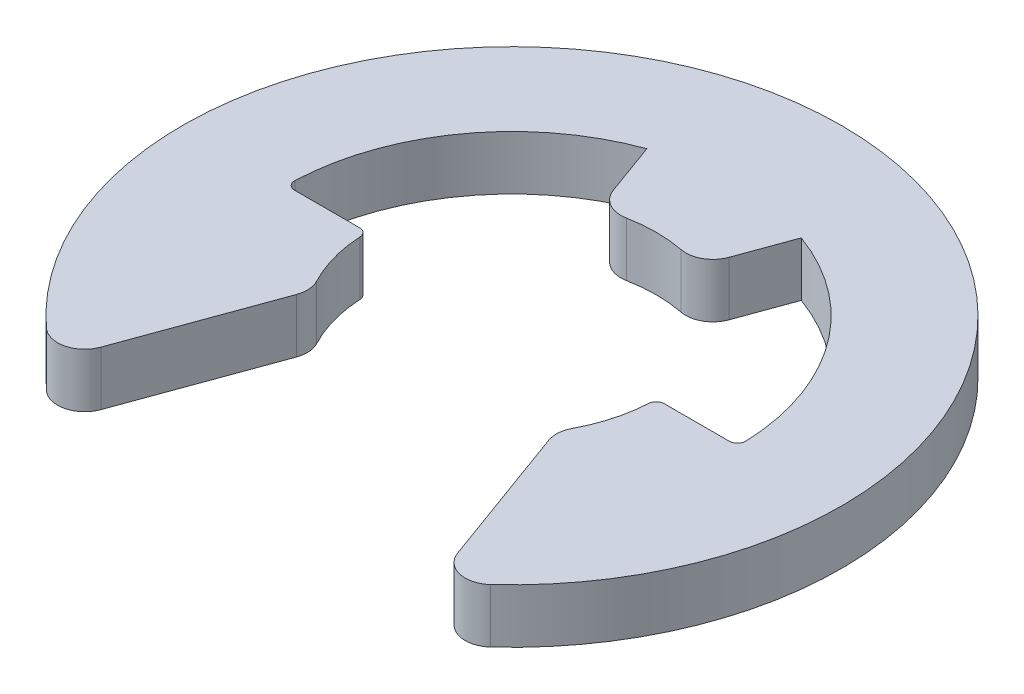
from build123d import *

# Parameters (mm, degrees)
BOSS_EXTRUDE1_DEPTH = 0.3
FILLET1_R           = 0.3
FILLET2_R           = 0.09


with BuildPart() as part:
    # Sketch2 → Boss-Extrude1 (new, symmetric)
    with BuildSketch(Plane(origin=(0, 0, 0), x_dir=(1, 0, 0), z_dir=(0, 1, 0))):
        with BuildLine():
            Line((-2.119097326, -2.971855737), (-1.35, -0.858778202))
            ThreePointArc((-1.35, -0.858778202), (-1.53622915, -0.447213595), (-1.6, 0))
            Line((-1.6, 0), (-2.5, 0))
            ThreePointArc((-2.5, 0), (-2.047880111, 1.433941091), (-0.855050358, 2.349231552))
            Line((-0.855050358, 2.349231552), (-0.547232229, 1.503508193))
            ThreePointArc((-0.547232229, 1.503508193), (0, 1.6), (0.547232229, 1.503508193))
            Line((0.547232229, 1.503508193), (0.855050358, 2.349231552))
            ThreePointArc((0.855050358, 2.349231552), (2.047880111, 1.433941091), (2.5, 0))
            Line((2.5, 0), (1.6, 0))
            ThreePointArc((1.6, 0), (1.53622915, -0.447213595), (1.35, -0.858778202))
            Line((1.35, -0.858778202), (2.119097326, -2.971855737))
            ThreePointArc((2.119097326, -2.971855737), (0, 3.65), (-2.119097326, -2.971855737))
        make_face()
    extrude(amount=BOSS_EXTRUDE1_DEPTH, both=True)

    # Fillet1
    fillet1_edges = [part.edges().sort_by_distance(p)[0] for p in [
        (-1.35, 0, 0.858778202),
        (-2.119097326, 0, 2.971855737),
        (2.119097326, 0, 2.971855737),
        (1.35, 0, 0.858778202),
        (0.547232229, 0, -1.503508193),
        (-0.547232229, 0, -1.503508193),
    ]]
    fillet(fillet1_edges, radius=FILLET1_R)

    # Fillet2
    fillet2_edges = [part.edges().sort_by_distance(p)[0] for p in [
        (-2.5, 0, 0),
        (-1.6, 0, 0),
        (1.6, 0, 0),
        (2.5, 0, 0),
    ]]
    fillet(fillet2_edges, radius=FILLET2_R)


solid = part.part
